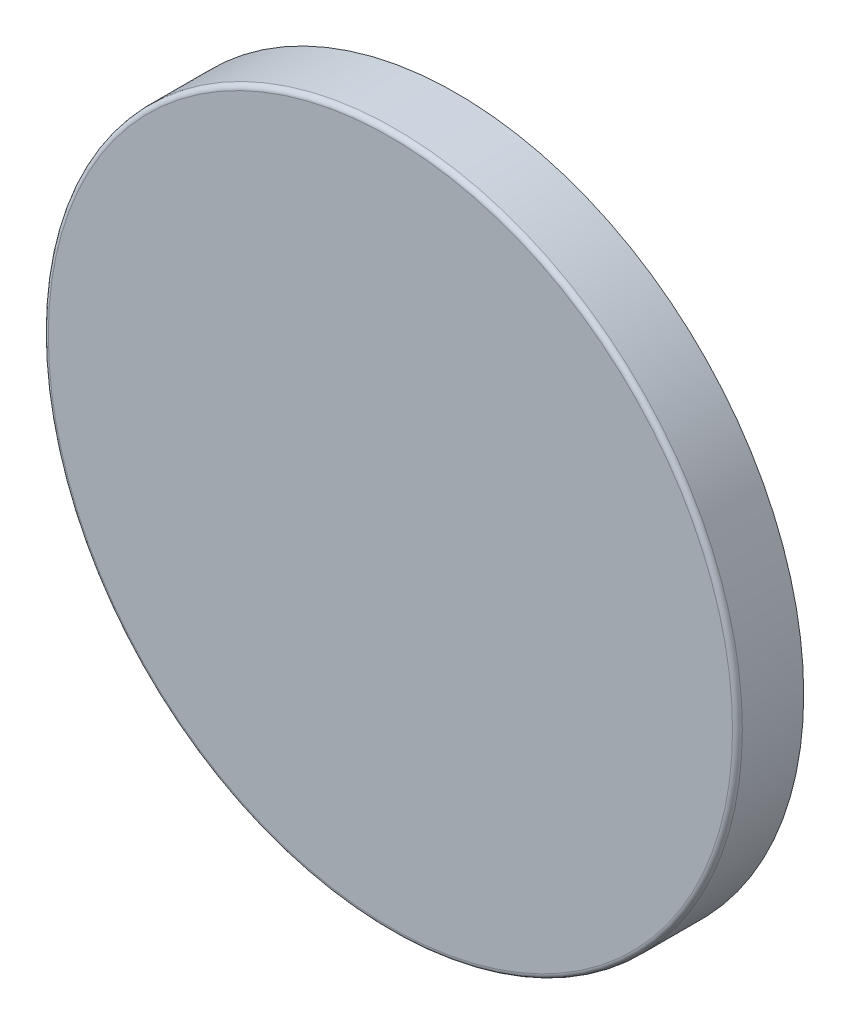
ISO-10303-21;
HEADER;
FILE_DESCRIPTION(('STEP AP214'),'2;1');
FILE_NAME('part.step','',(''),(''),'','','');
FILE_SCHEMA(('AUTOMOTIVE_DESIGN { 1 0 10303 214 1 1 1 1 }'));
ENDSEC;
DATA;
#1=APPLICATION_CONTEXT('core data for automotive mechanical design processes');
#2=APPLICATION_PROTOCOL_DEFINITION('international standard','automotive_design',2000,#1);
#3=PRODUCT_CONTEXT('',#1,'mechanical');
#4=PRODUCT('Part','Part','',(#3));
#5=PRODUCT_RELATED_PRODUCT_CATEGORY('part','',(#4));
#6=PRODUCT_DEFINITION_FORMATION('','',#4);
#7=PRODUCT_DEFINITION_CONTEXT('part definition',#1,'design');
#8=PRODUCT_DEFINITION('design','',#6,#7);
#9=PRODUCT_DEFINITION_SHAPE('','',#8);
#10=(LENGTH_UNIT() NAMED_UNIT(*) SI_UNIT(.MILLI.,.METRE.));
#11=(NAMED_UNIT(*) PLANE_ANGLE_UNIT() SI_UNIT($,.RADIAN.));
#12=(NAMED_UNIT(*) SI_UNIT($,.STERADIAN.) SOLID_ANGLE_UNIT());
#13=UNCERTAINTY_MEASURE_WITH_UNIT(LENGTH_MEASURE(1.E-05),#10,'distance_accuracy_value','');
#14=(GEOMETRIC_REPRESENTATION_CONTEXT(3) GLOBAL_UNCERTAINTY_ASSIGNED_CONTEXT((#13)) GLOBAL_UNIT_ASSIGNED_CONTEXT((#10,
#11,#12)) REPRESENTATION_CONTEXT('',''));
#15=CARTESIAN_POINT('',(0.,0.,0.));
#16=DIRECTION('',(0.,0.,1.));
#17=DIRECTION('',(1.,0.,0.));
#18=AXIS2_PLACEMENT_3D('',#15,#16,#17);
#19=CARTESIAN_POINT('',(-9.31999999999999,57.21,10.7));
#20=DIRECTION('',(0.,0.,1.));
#21=DIRECTION('',(1.,0.,0.));
#22=AXIS2_PLACEMENT_3D('',#19,#20,#21);
#23=PLANE('',#22);
#24=CARTESIAN_POINT('',(-9.31999999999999,57.21,10.7));
#25=DIRECTION('',(0.,0.,-1.));
#26=DIRECTION('',(-1.,0.,0.));
#27=AXIS2_PLACEMENT_3D('',#24,#25,#26);
#28=CIRCLE('',#27,6.97000000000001);
#29=CARTESIAN_POINT('',(-16.29,57.21,10.7));
#30=VERTEX_POINT('',#29);
#31=EDGE_CURVE('E26',#30,#30,#28,.T.);
#32=ORIENTED_EDGE('',*,*,#31,.F.);
#33=EDGE_LOOP('',(#32));
#34=FACE_BOUND('',#33,.T.);
#35=ADVANCED_FACE('F15',(#34),#23,.T.);
#36=CARTESIAN_POINT('',(-9.31999999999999,57.21,10.6));
#37=DIRECTION('',(0.,0.,1.));
#38=DIRECTION('',(1.,0.,0.));
#39=AXIS2_PLACEMENT_3D('',#36,#37,#38);
#40=TOROIDAL_SURFACE('',#39,6.97000000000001,0.1);
#41=CARTESIAN_POINT('',(-9.31999999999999,57.21,10.6));
#42=DIRECTION('',(0.,0.,-1.));
#43=DIRECTION('',(-1.,0.,0.));
#44=AXIS2_PLACEMENT_3D('',#41,#42,#43);
#45=CIRCLE('',#44,7.07000000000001);
#46=CARTESIAN_POINT('',(-16.39,57.21,10.6));
#47=VERTEX_POINT('',#46);
#48=EDGE_CURVE('E22',#47,#47,#45,.T.);
#49=ORIENTED_EDGE('',*,*,#48,.F.);
#50=EDGE_LOOP('',(#49));
#51=FACE_BOUND('',#50,.T.);
#52=ORIENTED_EDGE('',*,*,#31,.T.);
#53=EDGE_LOOP('',(#52));
#54=FACE_BOUND('',#53,.T.);
#55=ADVANCED_FACE('F36',(#51,#54),#40,.T.);
#56=CARTESIAN_POINT('',(-9.31999999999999,57.21,10.7));
#57=DIRECTION('',(0.,0.,-1.));
#58=DIRECTION('',(-1.,0.,0.));
#59=AXIS2_PLACEMENT_3D('',#56,#57,#58);
#60=CYLINDRICAL_SURFACE('',#59,7.07000000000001);
#61=ORIENTED_EDGE('',*,*,#48,.T.);
#62=EDGE_LOOP('',(#61));
#63=FACE_BOUND('',#62,.T.);
#64=CARTESIAN_POINT('',(-9.31999999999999,57.21,9.35));
#65=DIRECTION('',(0.,0.,-1.));
#66=DIRECTION('',(-1.,0.,0.));
#67=AXIS2_PLACEMENT_3D('',#64,#65,#66);
#68=CIRCLE('',#67,7.07000000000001);
#69=CARTESIAN_POINT('',(-16.39,57.21,9.35));
#70=VERTEX_POINT('',#69);
#71=EDGE_CURVE('E10',#70,#70,#68,.F.);
#72=ORIENTED_EDGE('',*,*,#71,.T.);
#73=EDGE_LOOP('',(#72));
#74=FACE_BOUND('',#73,.T.);
#75=ADVANCED_FACE('F40',(#63,#74),#60,.T.);
#76=CARTESIAN_POINT('',(-9.31999999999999,57.21,9.35));
#77=DIRECTION('',(0.,0.,1.));
#78=DIRECTION('',(1.,0.,0.));
#79=AXIS2_PLACEMENT_3D('',#76,#77,#78);
#80=PLANE('',#79);
#81=ORIENTED_EDGE('',*,*,#71,.F.);
#82=EDGE_LOOP('',(#81));
#83=FACE_BOUND('',#82,.T.);
#84=ADVANCED_FACE('F64',(#83),#80,.F.);
#85=CLOSED_SHELL('',(#35,#55,#75,#84));
#86=MANIFOLD_SOLID_BREP('B1',#85);
#87=ADVANCED_BREP_SHAPE_REPRESENTATION('',(#18,#86),#14);
#88=SHAPE_DEFINITION_REPRESENTATION(#9,#87);
ENDSEC;
END-ISO-10303-21;
